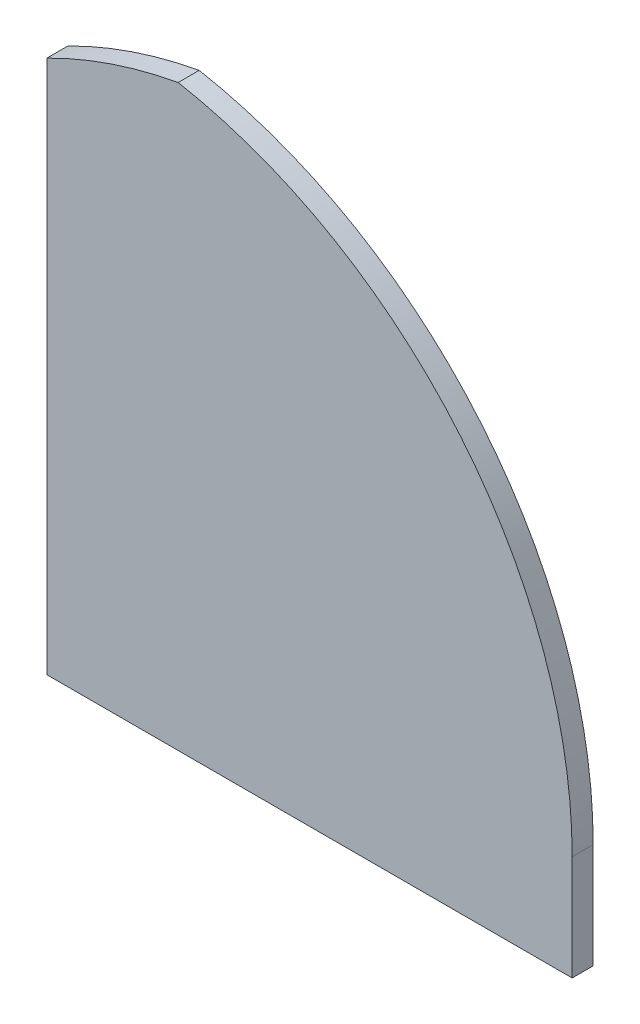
from build123d import *

# Parameters (mm, degrees)
SALIENTE_EXTRUIR1_DEPTH = 80


with BuildPart() as part:
    # Croquis1 → Saliente-Extruir1 (new body)
    with BuildSketch(Plane.XY):
        with BuildLine():
            Line((1518.298595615, -491.370616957), (-481.701404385, -491.370616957))
            Line((-481.701404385, -491.370616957), (-481.701404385, 1541.440775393))
            ThreePointArc((-481.701404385, 1541.440775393), (-237.84445908, 1644.397315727), (18.298595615, 1711.158041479))
            ThreePointArc((18.298595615, 1711.158041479), (1094.249475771, 1081.138398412), (1518.298595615, -91.370616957))
            Line((1518.298595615, -91.370616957), (1518.298595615, -491.370616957))
        make_face()
    extrude(amount=SALIENTE_EXTRUIR1_DEPTH)


solid = part.part
